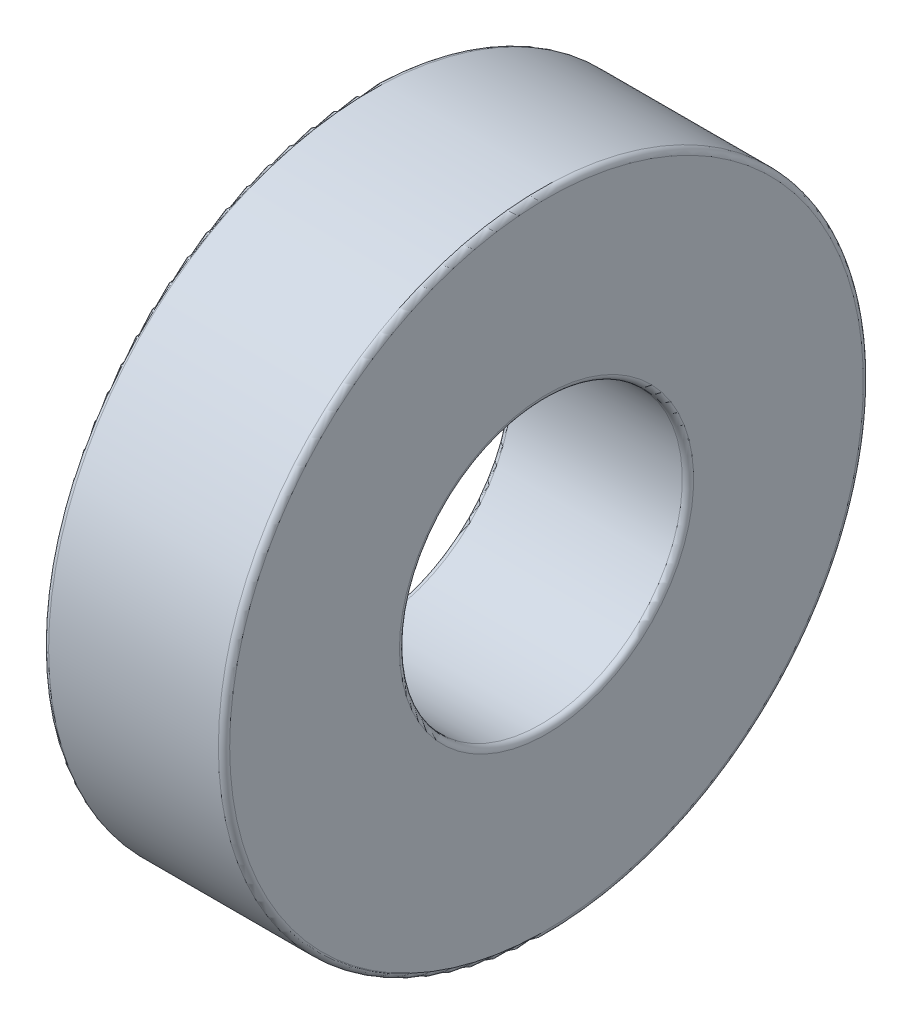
ISO-10303-21;
HEADER;
FILE_DESCRIPTION(('STEP AP214'),'2;1');
FILE_NAME('part.step','',(''),(''),'','','');
FILE_SCHEMA(('AUTOMOTIVE_DESIGN { 1 0 10303 214 1 1 1 1 }'));
ENDSEC;
DATA;
#1=APPLICATION_CONTEXT('core data for automotive mechanical design processes');
#2=APPLICATION_PROTOCOL_DEFINITION('international standard','automotive_design',2000,#1);
#3=PRODUCT_CONTEXT('',#1,'mechanical');
#4=PRODUCT('Part','Part','',(#3));
#5=PRODUCT_RELATED_PRODUCT_CATEGORY('part','',(#4));
#6=PRODUCT_DEFINITION_FORMATION('','',#4);
#7=PRODUCT_DEFINITION_CONTEXT('part definition',#1,'design');
#8=PRODUCT_DEFINITION('design','',#6,#7);
#9=PRODUCT_DEFINITION_SHAPE('','',#8);
#10=(LENGTH_UNIT() NAMED_UNIT(*) SI_UNIT(.MILLI.,.METRE.));
#11=(NAMED_UNIT(*) PLANE_ANGLE_UNIT() SI_UNIT($,.RADIAN.));
#12=(NAMED_UNIT(*) SI_UNIT($,.STERADIAN.) SOLID_ANGLE_UNIT());
#13=UNCERTAINTY_MEASURE_WITH_UNIT(LENGTH_MEASURE(1.E-05),#10,'distance_accuracy_value','');
#14=(GEOMETRIC_REPRESENTATION_CONTEXT(3) GLOBAL_UNCERTAINTY_ASSIGNED_CONTEXT((#13)) GLOBAL_UNIT_ASSIGNED_CONTEXT((#10,
#11,#12)) REPRESENTATION_CONTEXT('',''));
#15=CARTESIAN_POINT('',(0.,0.,0.));
#16=DIRECTION('',(0.,0.,1.));
#17=DIRECTION('',(1.,0.,0.));
#18=AXIS2_PLACEMENT_3D('',#15,#16,#17);
#19=CARTESIAN_POINT('',(0.499999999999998,0.,0.));
#20=DIRECTION('',(-1.,0.,0.));
#21=DIRECTION('',(0.,0.,1.));
#22=AXIS2_PLACEMENT_3D('',#19,#20,#21);
#23=TOROIDAL_SURFACE('',#22,28.,0.5);
#24=CARTESIAN_POINT('',(0.,0.,0.));
#25=DIRECTION('',(-1.,0.,0.));
#26=DIRECTION('',(0.,0.,1.));
#27=AXIS2_PLACEMENT_3D('',#24,#25,#26);
#28=CIRCLE('',#27,28.);
#29=CARTESIAN_POINT('',(0.,0.,28.));
#30=VERTEX_POINT('',#29);
#31=EDGE_CURVE('E10',#30,#30,#28,.T.);
#32=ORIENTED_EDGE('',*,*,#31,.F.);
#33=EDGE_LOOP('',(#32));
#34=FACE_BOUND('',#33,.T.);
#35=CARTESIAN_POINT('',(0.500000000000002,0.,0.));
#36=DIRECTION('',(-1.,0.,0.));
#37=DIRECTION('',(0.,0.,1.));
#38=AXIS2_PLACEMENT_3D('',#35,#36,#37);
#39=CIRCLE('',#38,28.5);
#40=CARTESIAN_POINT('',(0.500000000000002,0.,28.5));
#41=VERTEX_POINT('',#40);
#42=EDGE_CURVE('E52',#41,#41,#39,.T.);
#43=ORIENTED_EDGE('',*,*,#42,.T.);
#44=EDGE_LOOP('',(#43));
#45=FACE_BOUND('',#44,.T.);
#46=ADVANCED_FACE('F24',(#34,#45),#23,.T.);
#47=CARTESIAN_POINT('',(0.,28.,0.));
#48=DIRECTION('',(1.,0.,0.));
#49=DIRECTION('',(0.,0.,-1.));
#50=AXIS2_PLACEMENT_3D('',#47,#48,#49);
#51=PLANE('',#50);
#52=CARTESIAN_POINT('',(0.,0.,0.));
#53=DIRECTION('',(-1.,0.,0.));
#54=DIRECTION('',(0.,0.,1.));
#55=AXIS2_PLACEMENT_3D('',#52,#53,#54);
#56=CIRCLE('',#55,13.);
#57=CARTESIAN_POINT('',(0.,0.,13.));
#58=VERTEX_POINT('',#57);
#59=EDGE_CURVE('E30',#58,#58,#56,.T.);
#60=ORIENTED_EDGE('',*,*,#59,.F.);
#61=EDGE_LOOP('',(#60));
#62=FACE_BOUND('',#61,.T.);
#63=ORIENTED_EDGE('',*,*,#31,.T.);
#64=EDGE_LOOP('',(#63));
#65=FACE_BOUND('',#64,.T.);
#66=ADVANCED_FACE('F89',(#62,#65),#51,.F.);
#67=CARTESIAN_POINT('',(0.5,0.,0.));
#68=DIRECTION('',(-1.,0.,0.));
#69=DIRECTION('',(0.,0.,1.));
#70=AXIS2_PLACEMENT_3D('',#67,#68,#69);
#71=TOROIDAL_SURFACE('',#70,13.,0.5);
#72=CARTESIAN_POINT('',(0.500000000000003,0.,0.));
#73=DIRECTION('',(-1.,0.,0.));
#74=DIRECTION('',(0.,0.,1.));
#75=AXIS2_PLACEMENT_3D('',#72,#73,#74);
#76=CIRCLE('',#75,12.5);
#77=CARTESIAN_POINT('',(0.500000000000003,0.,12.5));
#78=VERTEX_POINT('',#77);
#79=EDGE_CURVE('E34',#78,#78,#76,.T.);
#80=ORIENTED_EDGE('',*,*,#79,.F.);
#81=EDGE_LOOP('',(#80));
#82=FACE_BOUND('',#81,.T.);
#83=ORIENTED_EDGE('',*,*,#59,.T.);
#84=EDGE_LOOP('',(#83));
#85=FACE_BOUND('',#84,.T.);
#86=ADVANCED_FACE('F84',(#82,#85),#71,.T.);
#87=CARTESIAN_POINT('',(0.,0.,0.));
#88=DIRECTION('',(-1.,0.,0.));
#89=DIRECTION('',(0.,0.,1.));
#90=AXIS2_PLACEMENT_3D('',#87,#88,#89);
#91=CYLINDRICAL_SURFACE('',#90,12.5);
#92=CARTESIAN_POINT('',(15.5,0.,0.));
#93=DIRECTION('',(-1.,0.,0.));
#94=DIRECTION('',(0.,0.,1.));
#95=AXIS2_PLACEMENT_3D('',#92,#93,#94);
#96=CIRCLE('',#95,12.5);
#97=CARTESIAN_POINT('',(15.5,0.,12.5));
#98=VERTEX_POINT('',#97);
#99=EDGE_CURVE('E38',#98,#98,#96,.T.);
#100=ORIENTED_EDGE('',*,*,#99,.F.);
#101=EDGE_LOOP('',(#100));
#102=FACE_BOUND('',#101,.T.);
#103=ORIENTED_EDGE('',*,*,#79,.T.);
#104=EDGE_LOOP('',(#103));
#105=FACE_BOUND('',#104,.T.);
#106=ADVANCED_FACE('F78',(#102,#105),#91,.F.);
#107=CARTESIAN_POINT('',(15.5,0.,0.));
#108=DIRECTION('',(-1.,0.,0.));
#109=DIRECTION('',(0.,0.,1.));
#110=AXIS2_PLACEMENT_3D('',#107,#108,#109);
#111=TOROIDAL_SURFACE('',#110,13.,0.5);
#112=CARTESIAN_POINT('',(16.,0.,0.));
#113=DIRECTION('',(-1.,0.,0.));
#114=DIRECTION('',(0.,0.,1.));
#115=AXIS2_PLACEMENT_3D('',#112,#113,#114);
#116=CIRCLE('',#115,13.);
#117=CARTESIAN_POINT('',(16.,0.,13.));
#118=VERTEX_POINT('',#117);
#119=EDGE_CURVE('E43',#118,#118,#116,.T.);
#120=ORIENTED_EDGE('',*,*,#119,.F.);
#121=EDGE_LOOP('',(#120));
#122=FACE_BOUND('',#121,.T.);
#123=ORIENTED_EDGE('',*,*,#99,.T.);
#124=EDGE_LOOP('',(#123));
#125=FACE_BOUND('',#124,.T.);
#126=ADVANCED_FACE('F72',(#122,#125),#111,.T.);
#127=CARTESIAN_POINT('',(16.,13.,0.));
#128=DIRECTION('',(-1.,0.,0.));
#129=DIRECTION('',(0.,0.,1.));
#130=AXIS2_PLACEMENT_3D('',#127,#128,#129);
#131=PLANE('',#130);
#132=CARTESIAN_POINT('',(16.,0.,0.));
#133=DIRECTION('',(-1.,0.,0.));
#134=DIRECTION('',(0.,0.,1.));
#135=AXIS2_PLACEMENT_3D('',#132,#133,#134);
#136=CIRCLE('',#135,28.);
#137=CARTESIAN_POINT('',(16.,0.,28.));
#138=VERTEX_POINT('',#137);
#139=EDGE_CURVE('E46',#138,#138,#136,.T.);
#140=ORIENTED_EDGE('',*,*,#139,.F.);
#141=EDGE_LOOP('',(#140));
#142=FACE_BOUND('',#141,.T.);
#143=ORIENTED_EDGE('',*,*,#119,.T.);
#144=EDGE_LOOP('',(#143));
#145=FACE_BOUND('',#144,.T.);
#146=ADVANCED_FACE('F66',(#142,#145),#131,.F.);
#147=CARTESIAN_POINT('',(15.5,0.,0.));
#148=DIRECTION('',(-1.,0.,0.));
#149=DIRECTION('',(0.,0.,1.));
#150=AXIS2_PLACEMENT_3D('',#147,#148,#149);
#151=TOROIDAL_SURFACE('',#150,28.,0.5);
#152=CARTESIAN_POINT('',(15.5,0.,0.));
#153=DIRECTION('',(-1.,0.,0.));
#154=DIRECTION('',(0.,0.,1.));
#155=AXIS2_PLACEMENT_3D('',#152,#153,#154);
#156=CIRCLE('',#155,28.5);
#157=CARTESIAN_POINT('',(15.5,0.,28.5));
#158=VERTEX_POINT('',#157);
#159=EDGE_CURVE('E49',#158,#158,#156,.T.);
#160=ORIENTED_EDGE('',*,*,#159,.F.);
#161=EDGE_LOOP('',(#160));
#162=FACE_BOUND('',#161,.T.);
#163=ORIENTED_EDGE('',*,*,#139,.T.);
#164=EDGE_LOOP('',(#163));
#165=FACE_BOUND('',#164,.T.);
#166=ADVANCED_FACE('F60',(#162,#165),#151,.T.);
#167=CARTESIAN_POINT('',(0.,0.,0.));
#168=DIRECTION('',(-1.,0.,0.));
#169=DIRECTION('',(0.,0.,1.));
#170=AXIS2_PLACEMENT_3D('',#167,#168,#169);
#171=CYLINDRICAL_SURFACE('',#170,28.5);
#172=ORIENTED_EDGE('',*,*,#42,.F.);
#173=EDGE_LOOP('',(#172));
#174=FACE_BOUND('',#173,.T.);
#175=ORIENTED_EDGE('',*,*,#159,.T.);
#176=EDGE_LOOP('',(#175));
#177=FACE_BOUND('',#176,.T.);
#178=ADVANCED_FACE('F57',(#174,#177),#171,.T.);
#179=CLOSED_SHELL('',(#46,#66,#86,#106,#126,#146,#166,#178));
#180=MANIFOLD_SOLID_BREP('B2',#179);
#181=ADVANCED_BREP_SHAPE_REPRESENTATION('',(#18,#180),#14);
#182=SHAPE_DEFINITION_REPRESENTATION(#9,#181);
ENDSEC;
END-ISO-10303-21;
